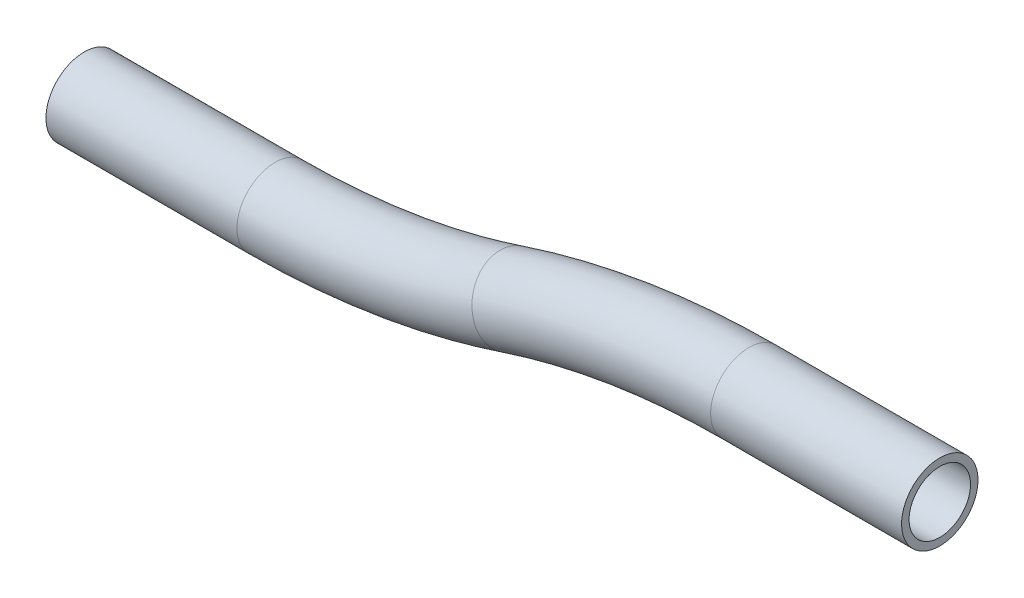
from build123d import *

# Parameters (mm, degrees)
SKETCH1_R   = 6.35
SKETCH1_R_2 = 5.1054


with BuildPart() as part:
    # Sweep1: sweep along a path in Sketch2
    with BuildLine(Plane.XY) as sweep1_path:
        Line((0, 0), (31.75, 0))
        ThreePointArc((31.75, 0), (51.689404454, 1.597692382), (71.12, 6.35))
        ThreePointArc((71.12, 6.35), (90.550595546, 11.102307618), (110.49, 12.7))
        Line((110.49, 12.7), (142.24, 12.7))
    # Sketch1 → Sweep1 (sweep)
    with BuildSketch(Plane(origin=(0, 0, 0), x_dir=(0, 0, -1), z_dir=(1, 0, 0))):
        Circle(SKETCH1_R)
        Circle(SKETCH1_R_2, mode=Mode.SUBTRACT)
    sweep(path=sweep1_path.line)


solid = part.part
